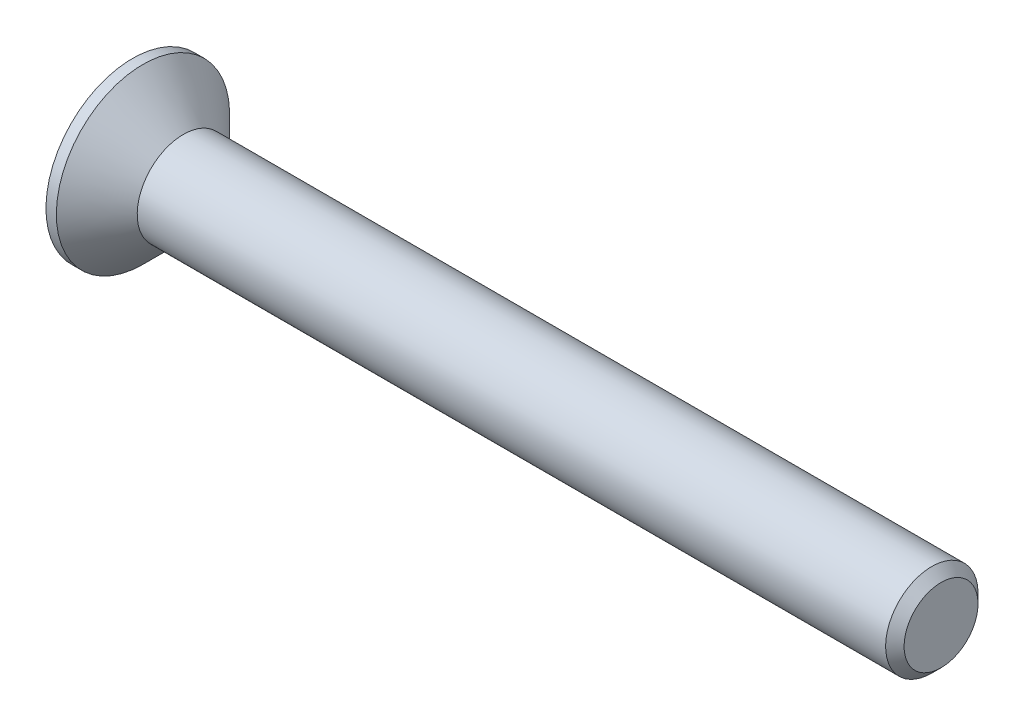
from build123d import *

# Parameters (mm, degrees)
CHAMFER1_SIZE      = 0.4
CUT_EXTRUDE1_DEPTH = 1.9


with BuildPart() as part:
    # Sketch1 → Revolve1 (revolve)
    with BuildSketch(Plane.XY, mode=Mode.PRIVATE) as revolve1_sk:
        Polygon((-2.2, 3.75), (-2.2, 0), (32.8, 0), (32.8, 2), (0, 2), (-1.75, 3.75), align=None)
    revolve(revolve1_sk.sketch.rotate(Axis((-2.2, 0, 0), (1, 0, 0)), 180), axis=Axis((-2.2, 0, 0), (1, 0, 0)))

    # Chamfer1
    chamfer1_edges = [part.edges().sort_by_distance(p)[0] for p in [
        (32.8, 2, 0),
    ]]
    chamfer(chamfer1_edges, length=CHAMFER1_SIZE)

    # Sketch2 → Cut-Extrude1 (cut)
    with BuildSketch(Plane.ZY.offset(2.2)):
        Polygon((-0.55, 2.2), (0.55, 2.2), (0.55, 0.55), (2.2, 0.55), (2.2, -0.55), (0.55, -0.55), (0.55, -2.2), (-0.55, -2.2), (-0.55, -0.55), (-2.2, -0.55), (-2.2, 0.55), (-0.55, 0.55), align=None)
    extrude(amount=-CUT_EXTRUDE1_DEPTH, mode=Mode.SUBTRACT)


solid = part.part
